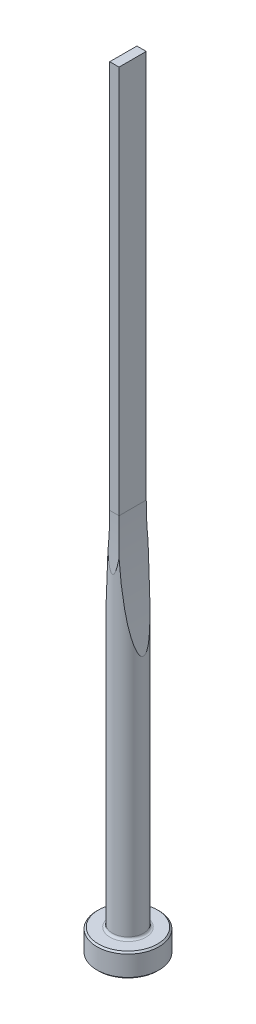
from build123d import *

# Parameters (mm, degrees)
CUT_EXTRUDE1_DEPTH = 5
CUT_EXTRUDE2_DEPTH = 5


with BuildPart() as part:
    # Sketch1 → Revolve1 (revolve)
    with BuildSketch(Plane.XY, mode=Mode.PRIVATE) as revolve1_sk:
        with BuildLine():
            Line((0, 0), (3.8, 0))
            Line((3.8, 0), (4, 0.2))
            Line((4, 0.2), (4, 2.8))
            Line((4, 2.8), (3.8, 3))
            Line((3.8, 3), (2.3, 3))
            ThreePointArc((2.3, 3), (2.087867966, 3.087867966), (2, 3.3))
            Line((2, 3.3), (2, 100))
            Line((2, 100), (0, 100))
            Line((0, 100), (0, 0))
        make_face()
    revolve(revolve1_sk.sketch.rotate(Axis((0, 100, 0), (0, -1, 0)), 180), axis=Axis((0, 100, 0), (0, -1, 0)))

    # Sketch2 → Cut-Extrude1 (cut, symmetric)
    with BuildSketch(Plane.XY):
        with BuildLine():
            Line((0.6, 100), (0.6, 50))
            ThreePointArc((0.6, 50), (0.950683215, 42.062746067), (2, 34.187346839))
            Line((2, 34.187346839), (2, 100))
            Line((2, 100), (0.6, 100))
        make_face()
        with BuildLine():
            Line((-0.6, 100), (-0.6, 50))
            ThreePointArc((-0.6, 50), (-0.950683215, 42.062746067), (-2, 34.187346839))
            Line((-2, 34.187346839), (-2, 100))
            Line((-2, 100), (-0.6, 100))
        make_face()
    extrude(amount=CUT_EXTRUDE1_DEPTH, both=True, mode=Mode.SUBTRACT)

    # Sketch3 → Cut-Extrude2 (cut, symmetric)
    with BuildSketch(Plane(origin=(0, 0, 0), x_dir=(0, 0, -1), z_dir=(1, 0, 0))):
        with BuildLine():
            Line((1.75, 100), (1.75, 50))
            ThreePointArc((1.75, 50), (1.812521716, 46.645898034), (2, 43.296456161))
            Line((2, 43.296456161), (2, 100))
            Line((2, 100), (1.75, 100))
        make_face()
        with BuildLine():
            Line((-1.75, 100), (-1.75, 50))
            ThreePointArc((-1.75, 50), (-1.812521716, 46.645898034), (-2, 43.296456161))
            Line((-2, 43.296456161), (-2, 100))
            Line((-2, 100), (-1.75, 100))
        make_face()
    extrude(amount=CUT_EXTRUDE2_DEPTH, both=True, mode=Mode.SUBTRACT)


solid = part.part
